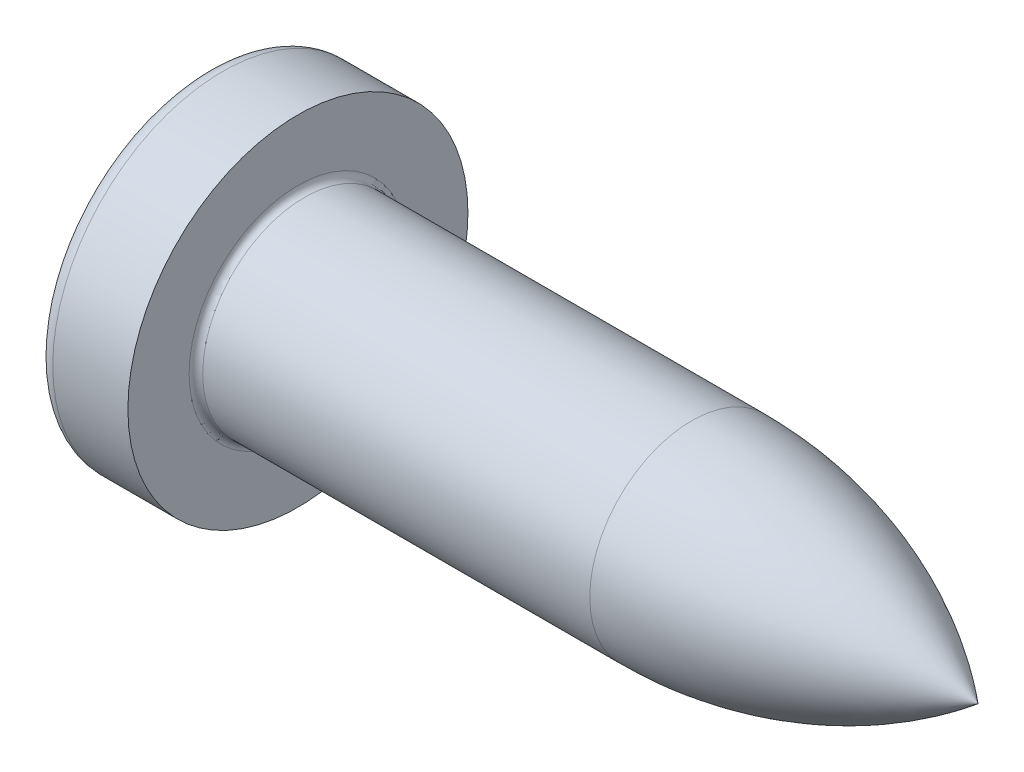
from build123d import *

# Parameters (mm, degrees)
FILLET1_R    = 0.1
RECPAT_COUNT = 2
RECPAT_ANGLE = 90


with BuildPart() as part:
    # BodySke → Base-Revolve (revolve)
    with BuildSketch(Plane.XY, mode=Mode.PRIVATE) as base_revolve_sk:
        with BuildLine():
            Line((2.1, 1.5), (2.1, 2.5))
            Line((2.1, 2.5), (0.99500416, 2.5))
            ThreePointArc((0.99500416, 2.5), (0.88781572, 2.474733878), (0.803195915, 2.404255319))
            ThreePointArc((0.803195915, 2.404255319), (0.206109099, 1.267435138), (0, 0))
            Line((0, 0), (12.1, 0))
            ThreePointArc((12.1, 0), (10.125311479, 1.113792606), (7.891307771, 1.5))
            Line((7.891307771, 1.5), (2.1, 1.5))
        make_face()
    revolve(base_revolve_sk.sketch.rotate(Axis((7.891307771, 0, 0), (1, 0, 0)), 90), axis=Axis((7.891307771, 0, 0), (1, 0, 0)))

    # Fillet1
    fillet1_edges = [part.edges().sort_by_distance(p)[0] for p in [
        (2.1, 0, -1.5),
    ]]
    fillet(fillet1_edges, radius=FILLET1_R)

    # Sketch3 → Recess section 0
    with BuildSketch(Plane(origin=(0, 0, 0), x_dir=(0, 0, -1), z_dir=(1, 0, 0))):
        with BuildLine():
            Line((0.37, -1.3), (-0.37, -1.3))
            Line((-0.37, -1.3), (-0.37, 1.3))
            Line((-0.37, 1.3), (0.37, 1.3))
            Line((0.37, 1.3), (0.37, -1.3))
        make_face()
    # Sketch4 → Recess section 1
    with BuildSketch(Plane(origin=(1.5, 0, 0), x_dir=(0, 0, -1), z_dir=(1, 0, 0))):
        with BuildLine():
            Line((0.37, -0.552127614), (-0.37, -0.552127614))
            Line((-0.37, -0.552127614), (-0.37, 0.552127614))
            Line((-0.37, 0.552127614), (0.37, 0.552127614))
            Line((0.37, 0.552127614), (0.37, -0.552127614))
        make_face()
    recess = loft(mode=Mode.SUBTRACT)

    # RecPat: Recess ×2 about axis
    recpat_axis = Axis((0, 0, 0), (1, 0, 0))
    for i in range(1, RECPAT_COUNT):
        add(recess.rotate(recpat_axis, i * RECPAT_ANGLE / (RECPAT_COUNT - 1)), mode=Mode.SUBTRACT)

    # RecCorSke → RecessCore (revolve, cut)
    with BuildSketch(Plane.XY, mode=Mode.PRIVATE) as recesscore_sk:
        Polygon((0, 0), (0, 0.660890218), (1.5, 0.556), (1.680655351, 0), align=None)
    revolve(recesscore_sk.sketch.rotate(Axis((-3.175, 0, 0), (1, 0, 0)), 17.145865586), axis=Axis((-3.175, 0, 0), (1, 0, 0)), mode=Mode.SUBTRACT)


solid = part.part
